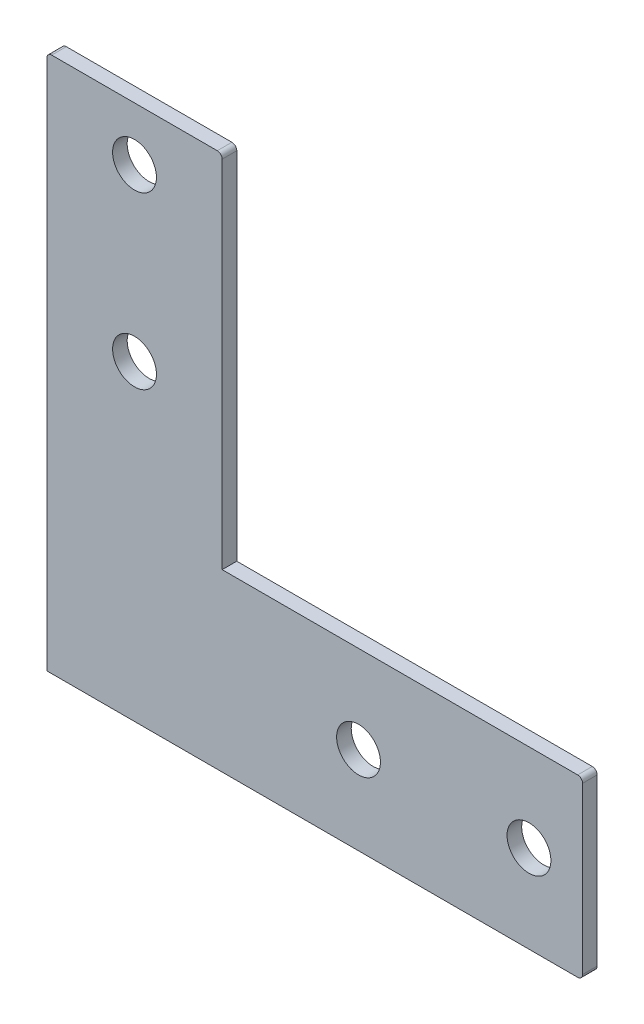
from build123d import *

# Parameters (mm, degrees)
SKETCH_1_R      = 4.5
EXTRUDE_1_DEPTH = 1.5
FILLET_1_R      = 1


with BuildPart() as part:
    # Sketch 1 → Extrude 1 (new, symmetric)
    with BuildSketch(Plane.XY):
        Polygon((0, 0), (0, 110), (36, 110), (36, 36), (110, 36), (110, 0), align=None)
        with Locations((18, 99)):
            Circle(SKETCH_1_R, mode=Mode.SUBTRACT)
        with Locations((18, 64)):
            Circle(SKETCH_1_R, mode=Mode.SUBTRACT)
        with Locations(Location((99, 18, 0), (0, 0, 180))):
            Circle(SKETCH_1_R, mode=Mode.SUBTRACT)
        with Locations(Location((64, 18, 0), (0, 0, 180))):
            Circle(SKETCH_1_R, mode=Mode.SUBTRACT)
    extrude(amount=EXTRUDE_1_DEPTH, both=True)

    # Fillet 1
    fillet_1_edges = [part.edges().sort_by_distance(p)[0] for p in [
        (0, 110, 0),
        (36, 110, 0),
        (110, 36, 0),
        (110, 0, 0),
    ]]
    fillet(fillet_1_edges, radius=FILLET_1_R)


solid = part.part
